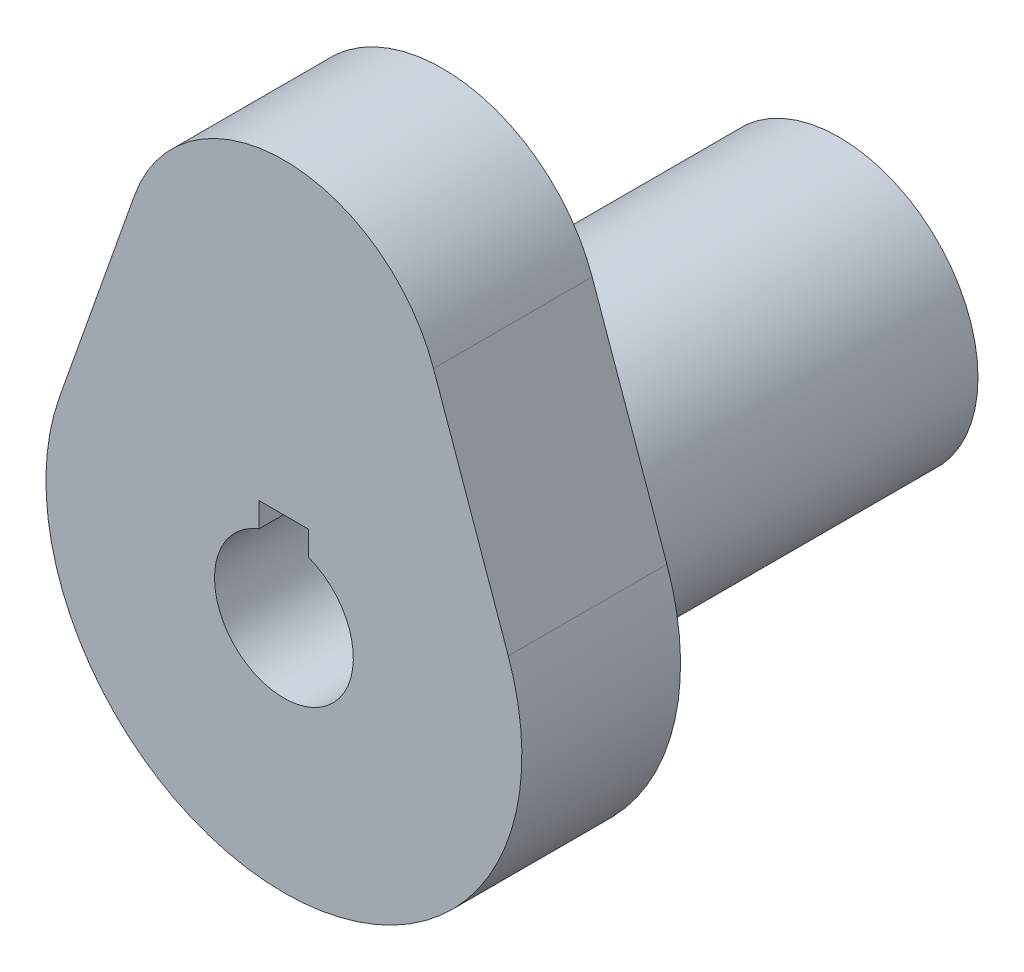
from build123d import *
from build123d.topology import SkipClean

# Parameters (mm, degrees)
SKETCH1_R           = 88.9
BOSS_EXTRUDE1_DEPTH = 203.2
BOSS_EXTRUDE2_START = 508
SKETCH2_R           = 177.8
SKETCH2_R_2         = 88.9
BOSS_EXTRUDE2_DEPTH = 508
CUT_EXTRUDE1_DEPTH  = 926.620051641


with BuildPart() as part:
    # Sketch1 → Boss-Extrude1 (new body)
    with BuildSketch(Plane.XY):
        with BuildLine():
            Line((-287.368195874, 101.6), (-191.578797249, 372.533333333))
            ThreePointArc((-191.578797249, 372.533333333), (0, 508), (191.578797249, 372.533333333))
            Line((191.578797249, 372.533333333), (287.368195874, 101.6))
            ThreePointArc((287.368195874, 101.6), (0, -304.8), (-287.368195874, 101.6))
        make_face()
        Circle(SKETCH1_R, mode=Mode.SUBTRACT)
    extrude(amount=BOSS_EXTRUDE1_DEPTH)

    # Sketch2 → Boss-Extrude2 (add)
    with SkipClean():  # the faces are left unmerged after this step: merging them gives an invalid solid
        with BuildSketch(Plane(origin=(0, 0, 0), x_dir=(-1, 0, 0), z_dir=(0, 0, -1)).offset(BOSS_EXTRUDE2_START)):
            with Locations(Location((0, 0, 0), (0, 0, 180))):
                Circle(SKETCH2_R)
            Circle(SKETCH2_R_2, mode=Mode.SUBTRACT)
        extrude(amount=-BOSS_EXTRUDE2_DEPTH)

    # Sketch3 → Cut-Extrude1 (cut, through all)
    with SkipClean():  # the faces are left unmerged after this step: merging them gives an invalid solid
        with BuildSketch(Plane.XY.offset(203.2)):
            with BuildLine():
                Line((-31.75, 114.3), (31.75, 114.3))
                Line((31.75, 114.3), (31.75, 83.037024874))
                ThreePointArc((31.75, 83.037024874), (0, 88.9), (-31.75, 83.037024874))
                Line((-31.75, 83.037024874), (-31.75, 114.3))
            make_face()
        extrude(amount=-CUT_EXTRUDE1_DEPTH, mode=Mode.SUBTRACT)


solid = part.part
